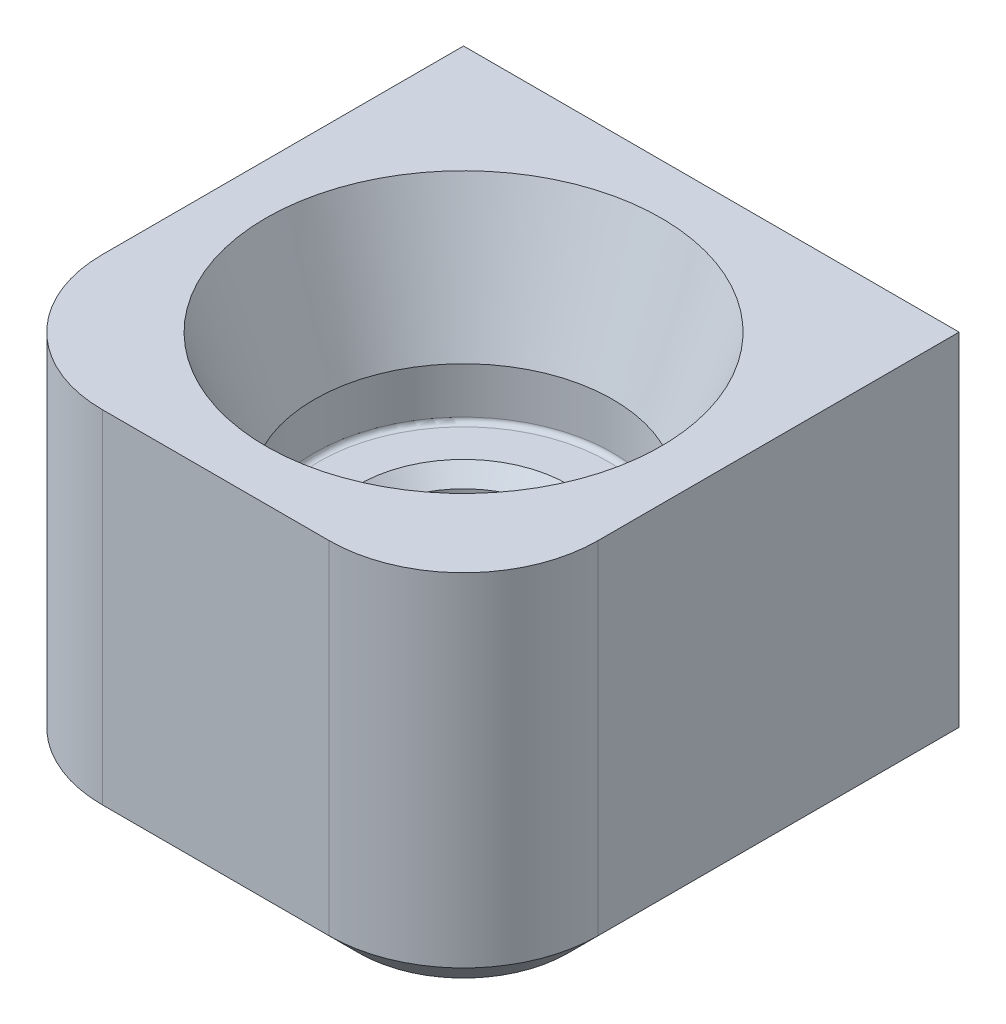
ISO-10303-21;
HEADER;
FILE_DESCRIPTION(('STEP AP214'),'2;1');
FILE_NAME('part.step','',(''),(''),'','','');
FILE_SCHEMA(('AUTOMOTIVE_DESIGN { 1 0 10303 214 1 1 1 1 }'));
ENDSEC;
DATA;
#1=APPLICATION_CONTEXT('core data for automotive mechanical design processes');
#2=APPLICATION_PROTOCOL_DEFINITION('international standard','automotive_design',2000,#1);
#3=PRODUCT_CONTEXT('',#1,'mechanical');
#4=PRODUCT('Part','Part','',(#3));
#5=PRODUCT_RELATED_PRODUCT_CATEGORY('part','',(#4));
#6=PRODUCT_DEFINITION_FORMATION('','',#4);
#7=PRODUCT_DEFINITION_CONTEXT('part definition',#1,'design');
#8=PRODUCT_DEFINITION('design','',#6,#7);
#9=PRODUCT_DEFINITION_SHAPE('','',#8);
#10=(LENGTH_UNIT() NAMED_UNIT(*) SI_UNIT(.MILLI.,.METRE.));
#11=(NAMED_UNIT(*) PLANE_ANGLE_UNIT() SI_UNIT($,.RADIAN.));
#12=(NAMED_UNIT(*) SI_UNIT($,.STERADIAN.) SOLID_ANGLE_UNIT());
#13=UNCERTAINTY_MEASURE_WITH_UNIT(LENGTH_MEASURE(1.E-05),#10,'distance_accuracy_value','');
#14=(GEOMETRIC_REPRESENTATION_CONTEXT(3) GLOBAL_UNCERTAINTY_ASSIGNED_CONTEXT((#13)) GLOBAL_UNIT_ASSIGNED_CONTEXT((#10,
#11,#12)) REPRESENTATION_CONTEXT('',''));
#15=CARTESIAN_POINT('',(0.,0.,0.));
#16=DIRECTION('',(0.,0.,1.));
#17=DIRECTION('',(1.,0.,0.));
#18=AXIS2_PLACEMENT_3D('',#15,#16,#17);
#19=CARTESIAN_POINT('',(-6.3246,9.4996,-6.3246));
#20=DIRECTION('',(1.,0.,0.));
#21=DIRECTION('',(0.,0.,-1.));
#22=AXIS2_PLACEMENT_3D('',#19,#20,#21);
#23=PLANE('',#22);
#24=DIRECTION('',(0.,-1.,0.));
#25=VECTOR('',#24,1.);
#26=CARTESIAN_POINT('',(-6.3246,9.4996,-6.3246));
#27=LINE('',#26,#25);
#28=CARTESIAN_POINT('',(-6.3246,9.4996,-6.3246));
#29=VERTEX_POINT('',#28);
#30=CARTESIAN_POINT('',(-6.3246,0.762000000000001,-6.3246));
#31=VERTEX_POINT('',#30);
#32=EDGE_CURVE('E229',#29,#31,#27,.T.);
#33=ORIENTED_EDGE('',*,*,#32,.T.);
#34=DIRECTION('',(0.,0.,1.));
#35=VECTOR('',#34,1.);
#36=CARTESIAN_POINT('',(-6.3246,0.762000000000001,-6.3246));
#37=LINE('',#36,#35);
#38=CARTESIAN_POINT('',(-6.3246,0.762000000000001,2.8956));
#39=VERTEX_POINT('',#38);
#40=EDGE_CURVE('E132',#31,#39,#37,.T.);
#41=ORIENTED_EDGE('',*,*,#40,.T.);
#42=DIRECTION('',(0.,-1.,0.));
#43=VECTOR('',#42,1.);
#44=CARTESIAN_POINT('',(-6.3246,9.4996,2.8956));
#45=LINE('',#44,#43);
#46=CARTESIAN_POINT('',(-6.3246,9.4996,2.8956));
#47=VERTEX_POINT('',#46);
#48=EDGE_CURVE('E113',#47,#39,#45,.T.);
#49=ORIENTED_EDGE('',*,*,#48,.F.);
#50=DIRECTION('',(0.,0.,1.));
#51=VECTOR('',#50,1.);
#52=CARTESIAN_POINT('',(-6.3246,9.4996,-6.3246));
#53=LINE('',#52,#51);
#54=EDGE_CURVE('E119',#29,#47,#53,.T.);
#55=ORIENTED_EDGE('',*,*,#54,.F.);
#56=EDGE_LOOP('',(#33,#41,#49,#55));
#57=FACE_BOUND('',#56,.T.);
#58=ADVANCED_FACE('F34',(#57),#23,.F.);
#59=CARTESIAN_POINT('',(-2.8956,9.4996,2.8956));
#60=DIRECTION('',(0.,-1.,0.));
#61=DIRECTION('',(0.,0.,-1.));
#62=AXIS2_PLACEMENT_3D('',#59,#60,#61);
#63=CYLINDRICAL_SURFACE('',#62,3.429);
#64=ORIENTED_EDGE('',*,*,#48,.T.);
#65=CARTESIAN_POINT('',(-2.8956,0.762000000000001,2.8956));
#66=DIRECTION('',(0.,1.,0.));
#67=DIRECTION('',(0.,0.,1.));
#68=AXIS2_PLACEMENT_3D('',#65,#66,#67);
#69=CIRCLE('',#68,3.429);
#70=CARTESIAN_POINT('',(-2.8956,0.762000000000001,6.3246));
#71=VERTEX_POINT('',#70);
#72=EDGE_CURVE('E152',#39,#71,#69,.T.);
#73=ORIENTED_EDGE('',*,*,#72,.T.);
#74=DIRECTION('',(0.,-1.,0.));
#75=VECTOR('',#74,1.);
#76=CARTESIAN_POINT('',(-2.8956,9.4996,6.3246));
#77=LINE('',#76,#75);
#78=CARTESIAN_POINT('',(-2.8956,9.4996,6.3246));
#79=VERTEX_POINT('',#78);
#80=EDGE_CURVE('E115',#79,#71,#77,.T.);
#81=ORIENTED_EDGE('',*,*,#80,.F.);
#82=CARTESIAN_POINT('',(-2.8956,9.4996,2.8956));
#83=DIRECTION('',(0.,1.,0.));
#84=DIRECTION('',(0.,0.,1.));
#85=AXIS2_PLACEMENT_3D('',#82,#83,#84);
#86=CIRCLE('',#85,3.429);
#87=EDGE_CURVE('E109',#47,#79,#86,.T.);
#88=ORIENTED_EDGE('',*,*,#87,.F.);
#89=EDGE_LOOP('',(#64,#73,#81,#88));
#90=FACE_BOUND('',#89,.T.);
#91=ADVANCED_FACE('F111',(#90),#63,.T.);
#92=CARTESIAN_POINT('',(-2.8956,9.4996,6.3246));
#93=DIRECTION('',(0.,0.,-1.));
#94=DIRECTION('',(-1.,0.,0.));
#95=AXIS2_PLACEMENT_3D('',#92,#93,#94);
#96=PLANE('',#95);
#97=ORIENTED_EDGE('',*,*,#80,.T.);
#98=DIRECTION('',(1.,0.,0.));
#99=VECTOR('',#98,1.);
#100=CARTESIAN_POINT('',(-2.8956,0.762000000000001,6.3246));
#101=LINE('',#100,#99);
#102=CARTESIAN_POINT('',(2.8956,0.762000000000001,6.3246));
#103=VERTEX_POINT('',#102);
#104=EDGE_CURVE('E154',#71,#103,#101,.T.);
#105=ORIENTED_EDGE('',*,*,#104,.T.);
#106=DIRECTION('',(0.,-1.,0.));
#107=VECTOR('',#106,1.);
#108=CARTESIAN_POINT('',(2.8956,9.4996,6.3246));
#109=LINE('',#108,#107);
#110=CARTESIAN_POINT('',(2.8956,9.4996,6.3246));
#111=VERTEX_POINT('',#110);
#112=EDGE_CURVE('E136',#111,#103,#109,.T.);
#113=ORIENTED_EDGE('',*,*,#112,.F.);
#114=DIRECTION('',(1.,0.,0.));
#115=VECTOR('',#114,1.);
#116=CARTESIAN_POINT('',(-2.8956,9.4996,6.3246));
#117=LINE('',#116,#115);
#118=EDGE_CURVE('E118',#79,#111,#117,.T.);
#119=ORIENTED_EDGE('',*,*,#118,.F.);
#120=EDGE_LOOP('',(#97,#105,#113,#119));
#121=FACE_BOUND('',#120,.T.);
#122=ADVANCED_FACE('F211',(#121),#96,.F.);
#123=CARTESIAN_POINT('',(2.8956,9.4996,2.8956));
#124=DIRECTION('',(0.,-1.,0.));
#125=DIRECTION('',(0.,0.,-1.));
#126=AXIS2_PLACEMENT_3D('',#123,#124,#125);
#127=CYLINDRICAL_SURFACE('',#126,3.429);
#128=ORIENTED_EDGE('',*,*,#112,.T.);
#129=CARTESIAN_POINT('',(2.8956,0.762000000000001,2.8956));
#130=DIRECTION('',(0.,1.,0.));
#131=DIRECTION('',(0.,0.,1.));
#132=AXIS2_PLACEMENT_3D('',#129,#130,#131);
#133=CIRCLE('',#132,3.429);
#134=CARTESIAN_POINT('',(6.3246,0.762000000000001,2.8956));
#135=VERTEX_POINT('',#134);
#136=EDGE_CURVE('E58',#103,#135,#133,.T.);
#137=ORIENTED_EDGE('',*,*,#136,.T.);
#138=DIRECTION('',(0.,-1.,0.));
#139=VECTOR('',#138,1.);
#140=CARTESIAN_POINT('',(6.3246,9.4996,2.8956));
#141=LINE('',#140,#139);
#142=CARTESIAN_POINT('',(6.3246,9.4996,2.8956));
#143=VERTEX_POINT('',#142);
#144=EDGE_CURVE('E232',#143,#135,#141,.T.);
#145=ORIENTED_EDGE('',*,*,#144,.F.);
#146=CARTESIAN_POINT('',(2.8956,9.4996,2.8956));
#147=DIRECTION('',(0.,1.,0.));
#148=DIRECTION('',(0.,0.,1.));
#149=AXIS2_PLACEMENT_3D('',#146,#147,#148);
#150=CIRCLE('',#149,3.429);
#151=EDGE_CURVE('E240',#111,#143,#150,.T.);
#152=ORIENTED_EDGE('',*,*,#151,.F.);
#153=EDGE_LOOP('',(#128,#137,#145,#152));
#154=FACE_BOUND('',#153,.T.);
#155=ADVANCED_FACE('F239',(#154),#127,.T.);
#156=CARTESIAN_POINT('',(6.3246,9.4996,-6.3246));
#157=DIRECTION('',(-1.,0.,0.));
#158=DIRECTION('',(0.,0.,1.));
#159=AXIS2_PLACEMENT_3D('',#156,#157,#158);
#160=PLANE('',#159);
#161=ORIENTED_EDGE('',*,*,#144,.T.);
#162=DIRECTION('',(0.,0.,-1.));
#163=VECTOR('',#162,1.);
#164=CARTESIAN_POINT('',(6.3246,0.762000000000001,-6.3246));
#165=LINE('',#164,#163);
#166=CARTESIAN_POINT('',(6.3246,0.762000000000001,-6.3246));
#167=VERTEX_POINT('',#166);
#168=EDGE_CURVE('E50',#135,#167,#165,.T.);
#169=ORIENTED_EDGE('',*,*,#168,.T.);
#170=DIRECTION('',(0.,-1.,0.));
#171=VECTOR('',#170,1.);
#172=CARTESIAN_POINT('',(6.3246,9.4996,-6.3246));
#173=LINE('',#172,#171);
#174=CARTESIAN_POINT('',(6.3246,9.4996,-6.3246));
#175=VERTEX_POINT('',#174);
#176=EDGE_CURVE('E230',#175,#167,#173,.T.);
#177=ORIENTED_EDGE('',*,*,#176,.F.);
#178=DIRECTION('',(0.,0.,-1.));
#179=VECTOR('',#178,1.);
#180=CARTESIAN_POINT('',(6.3246,9.4996,-6.3246));
#181=LINE('',#180,#179);
#182=EDGE_CURVE('E234',#143,#175,#181,.T.);
#183=ORIENTED_EDGE('',*,*,#182,.F.);
#184=EDGE_LOOP('',(#161,#169,#177,#183));
#185=FACE_BOUND('',#184,.T.);
#186=ADVANCED_FACE('F263',(#185),#160,.F.);
#187=CARTESIAN_POINT('',(-6.3246,9.4996,-6.3246));
#188=DIRECTION('',(0.,0.,1.));
#189=DIRECTION('',(1.,0.,0.));
#190=AXIS2_PLACEMENT_3D('',#187,#188,#189);
#191=PLANE('',#190);
#192=ORIENTED_EDGE('',*,*,#176,.T.);
#193=DIRECTION('',(-1.,0.,0.));
#194=VECTOR('',#193,1.);
#195=CARTESIAN_POINT('',(-6.3246,0.762000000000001,-6.3246));
#196=LINE('',#195,#194);
#197=EDGE_CURVE('E157',#167,#31,#196,.T.);
#198=ORIENTED_EDGE('',*,*,#197,.T.);
#199=ORIENTED_EDGE('',*,*,#32,.F.);
#200=DIRECTION('',(-1.,0.,0.));
#201=VECTOR('',#200,1.);
#202=CARTESIAN_POINT('',(-6.3246,9.4996,-6.3246));
#203=LINE('',#202,#201);
#204=EDGE_CURVE('E124',#175,#29,#203,.T.);
#205=ORIENTED_EDGE('',*,*,#204,.F.);
#206=EDGE_LOOP('',(#192,#198,#199,#205));
#207=FACE_BOUND('',#206,.T.);
#208=ADVANCED_FACE('F228',(#207),#191,.F.);
#209=CARTESIAN_POINT('',(-2.8956,9.4996,2.8956));
#210=DIRECTION('',(0.,1.,0.));
#211=DIRECTION('',(0.,0.,1.));
#212=AXIS2_PLACEMENT_3D('',#209,#210,#211);
#213=PLANE('',#212);
#214=CARTESIAN_POINT('',(0.,9.4996,0.));
#215=DIRECTION('',(0.,1.,0.));
#216=DIRECTION('',(-1.,0.,0.));
#217=AXIS2_PLACEMENT_3D('',#214,#215,#216);
#218=CIRCLE('',#217,5.04503453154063);
#219=CARTESIAN_POINT('',(-5.04503453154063,9.4996,0.));
#220=VERTEX_POINT('',#219);
#221=EDGE_CURVE('E177',#220,#220,#218,.T.);
#222=ORIENTED_EDGE('',*,*,#221,.F.);
#223=EDGE_LOOP('',(#222));
#224=FACE_BOUND('',#223,.T.);
#225=ORIENTED_EDGE('',*,*,#54,.T.);
#226=ORIENTED_EDGE('',*,*,#87,.T.);
#227=ORIENTED_EDGE('',*,*,#118,.T.);
#228=ORIENTED_EDGE('',*,*,#151,.T.);
#229=ORIENTED_EDGE('',*,*,#182,.T.);
#230=ORIENTED_EDGE('',*,*,#204,.T.);
#231=EDGE_LOOP('',(#225,#226,#227,#228,#229,#230));
#232=FACE_BOUND('',#231,.T.);
#233=ADVANCED_FACE('F122',(#224,#232),#213,.T.);
#234=CARTESIAN_POINT('',(-2.8956,0.,2.8956));
#235=DIRECTION('',(0.,1.,0.));
#236=DIRECTION('',(0.,0.,1.));
#237=AXIS2_PLACEMENT_3D('',#234,#235,#236);
#238=PLANE('',#237);
#239=CARTESIAN_POINT('',(0.,0.,0.));
#240=DIRECTION('',(0.,1.,0.));
#241=DIRECTION('',(0.,0.,1.));
#242=AXIS2_PLACEMENT_3D('',#239,#240,#241);
#243=CIRCLE('',#242,2.667);
#244=CARTESIAN_POINT('',(0.,0.,2.667));
#245=VERTEX_POINT('',#244);
#246=EDGE_CURVE('E160',#245,#245,#243,.T.);
#247=ORIENTED_EDGE('',*,*,#246,.T.);
#248=EDGE_LOOP('',(#247));
#249=FACE_BOUND('',#248,.T.);
#250=CARTESIAN_POINT('',(-2.8956,0.,2.8956));
#251=DIRECTION('',(0.,1.,0.));
#252=DIRECTION('',(0.,0.,1.));
#253=AXIS2_PLACEMENT_3D('',#250,#251,#252);
#254=CIRCLE('',#253,2.667);
#255=CARTESIAN_POINT('',(-2.8956,0.,5.5626));
#256=VERTEX_POINT('',#255);
#257=CARTESIAN_POINT('',(-5.5626,0.,2.8956));
#258=VERTEX_POINT('',#257);
#259=EDGE_CURVE('E147',#256,#258,#254,.F.);
#260=ORIENTED_EDGE('',*,*,#259,.T.);
#261=DIRECTION('',(0.,0.,-1.));
#262=VECTOR('',#261,1.);
#263=CARTESIAN_POINT('',(-5.5626,0.,2.8956));
#264=LINE('',#263,#262);
#265=CARTESIAN_POINT('',(-5.5626,0.,-5.5626));
#266=VERTEX_POINT('',#265);
#267=EDGE_CURVE('E149',#258,#266,#264,.T.);
#268=ORIENTED_EDGE('',*,*,#267,.T.);
#269=DIRECTION('',(1.,0.,0.));
#270=VECTOR('',#269,1.);
#271=CARTESIAN_POINT('',(-2.8956,0.,-5.5626));
#272=LINE('',#271,#270);
#273=CARTESIAN_POINT('',(5.5626,0.,-5.5626));
#274=VERTEX_POINT('',#273);
#275=EDGE_CURVE('E141',#266,#274,#272,.T.);
#276=ORIENTED_EDGE('',*,*,#275,.T.);
#277=DIRECTION('',(0.,0.,1.));
#278=VECTOR('',#277,1.);
#279=CARTESIAN_POINT('',(5.5626,0.,2.8956));
#280=LINE('',#279,#278);
#281=CARTESIAN_POINT('',(5.5626,0.,2.8956));
#282=VERTEX_POINT('',#281);
#283=EDGE_CURVE('E134',#274,#282,#280,.T.);
#284=ORIENTED_EDGE('',*,*,#283,.T.);
#285=CARTESIAN_POINT('',(2.8956,0.,2.8956));
#286=DIRECTION('',(0.,1.,0.));
#287=DIRECTION('',(0.,0.,1.));
#288=AXIS2_PLACEMENT_3D('',#285,#286,#287);
#289=CIRCLE('',#288,2.667);
#290=CARTESIAN_POINT('',(2.8956,0.,5.5626));
#291=VERTEX_POINT('',#290);
#292=EDGE_CURVE('E143',#282,#291,#289,.F.);
#293=ORIENTED_EDGE('',*,*,#292,.T.);
#294=DIRECTION('',(-1.,0.,0.));
#295=VECTOR('',#294,1.);
#296=CARTESIAN_POINT('',(-2.8956,0.,5.5626));
#297=LINE('',#296,#295);
#298=EDGE_CURVE('E145',#291,#256,#297,.T.);
#299=ORIENTED_EDGE('',*,*,#298,.T.);
#300=EDGE_LOOP('',(#260,#268,#276,#284,#293,#299));
#301=FACE_BOUND('',#300,.T.);
#302=ADVANCED_FACE('F194',(#249,#301),#238,.F.);
#303=CARTESIAN_POINT('',(0.,9.4996,0.));
#304=DIRECTION('',(0.,1.,0.));
#305=DIRECTION('',(-1.,0.,0.));
#306=AXIS2_PLACEMENT_3D('',#303,#304,#305);
#307=CYLINDRICAL_SURFACE('',#306,2.286);
#308=CARTESIAN_POINT('',(0.,0.380999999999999,0.));
#309=DIRECTION('',(0.,1.,0.));
#310=DIRECTION('',(-1.,0.,0.));
#311=AXIS2_PLACEMENT_3D('',#308,#309,#310);
#312=CIRCLE('',#311,2.286);
#313=CARTESIAN_POINT('',(-2.286,0.380999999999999,0.));
#314=VERTEX_POINT('',#313);
#315=EDGE_CURVE('E43',#314,#314,#312,.F.);
#316=ORIENTED_EDGE('',*,*,#315,.T.);
#317=EDGE_LOOP('',(#316));
#318=FACE_BOUND('',#317,.T.);
#319=CARTESIAN_POINT('',(0.,4.4196,0.));
#320=DIRECTION('',(0.,-1.,0.));
#321=DIRECTION('',(1.,0.,0.));
#322=AXIS2_PLACEMENT_3D('',#319,#320,#321);
#323=CIRCLE('',#322,2.286);
#324=CARTESIAN_POINT('',(2.286,4.4196,0.));
#325=VERTEX_POINT('',#324);
#326=EDGE_CURVE('E180',#325,#325,#323,.F.);
#327=ORIENTED_EDGE('',*,*,#326,.T.);
#328=EDGE_LOOP('',(#327));
#329=FACE_BOUND('',#328,.T.);
#330=ADVANCED_FACE('F185',(#318,#329),#307,.F.);
#331=CARTESIAN_POINT('',(-3.683,4.8006,0.));
#332=DIRECTION('',(0.,-1.,0.));
#333=DIRECTION('',(1.,0.,0.));
#334=AXIS2_PLACEMENT_3D('',#331,#332,#333);
#335=PLANE('',#334);
#336=CARTESIAN_POINT('',(0.,4.8006,0.));
#337=DIRECTION('',(0.,-1.,0.));
#338=DIRECTION('',(1.,0.,0.));
#339=AXIS2_PLACEMENT_3D('',#336,#337,#338);
#340=CIRCLE('',#339,2.667);
#341=CARTESIAN_POINT('',(2.667,4.8006,0.));
#342=VERTEX_POINT('',#341);
#343=EDGE_CURVE('E11',#342,#342,#340,.T.);
#344=ORIENTED_EDGE('',*,*,#343,.T.);
#345=EDGE_LOOP('',(#344));
#346=FACE_BOUND('',#345,.T.);
#347=CARTESIAN_POINT('',(0.,4.8006,0.));
#348=DIRECTION('',(0.,1.,0.));
#349=DIRECTION('',(-1.,0.,0.));
#350=AXIS2_PLACEMENT_3D('',#347,#348,#349);
#351=CIRCLE('',#350,3.683);
#352=CARTESIAN_POINT('',(-3.683,4.8006,0.));
#353=VERTEX_POINT('',#352);
#354=EDGE_CURVE('E128',#353,#353,#351,.T.);
#355=ORIENTED_EDGE('',*,*,#354,.T.);
#356=EDGE_LOOP('',(#355));
#357=FACE_BOUND('',#356,.T.);
#358=ADVANCED_FACE('F324',(#346,#357),#335,.F.);
#359=CARTESIAN_POINT('',(0.,4.9276,0.));
#360=DIRECTION('',(0.,1.,0.));
#361=DIRECTION('',(-1.,0.,0.));
#362=AXIS2_PLACEMENT_3D('',#359,#360,#361);
#363=TOROIDAL_SURFACE('',#362,3.683,0.127);
#364=ORIENTED_EDGE('',*,*,#354,.F.);
#365=EDGE_LOOP('',(#364));
#366=FACE_BOUND('',#365,.T.);
#367=CARTESIAN_POINT('',(0.,4.9276,0.));
#368=DIRECTION('',(0.,1.,0.));
#369=DIRECTION('',(-1.,0.,0.));
#370=AXIS2_PLACEMENT_3D('',#367,#368,#369);
#371=CIRCLE('',#370,3.81);
#372=CARTESIAN_POINT('',(-3.81,4.9276,0.));
#373=VERTEX_POINT('',#372);
#374=EDGE_CURVE('E247',#373,#373,#371,.T.);
#375=ORIENTED_EDGE('',*,*,#374,.T.);
#376=EDGE_LOOP('',(#375));
#377=FACE_BOUND('',#376,.T.);
#378=ADVANCED_FACE('F317',(#366,#377),#363,.F.);
#379=CARTESIAN_POINT('',(0.,9.4996,0.));
#380=DIRECTION('',(0.,1.,0.));
#381=DIRECTION('',(-1.,0.,0.));
#382=AXIS2_PLACEMENT_3D('',#379,#380,#381);
#383=CYLINDRICAL_SURFACE('',#382,3.81);
#384=ORIENTED_EDGE('',*,*,#374,.F.);
#385=EDGE_LOOP('',(#384));
#386=FACE_BOUND('',#385,.T.);
#387=CARTESIAN_POINT('',(0.,6.10637051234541,0.));
#388=DIRECTION('',(0.,1.,0.));
#389=DIRECTION('',(-1.,0.,0.));
#390=AXIS2_PLACEMENT_3D('',#387,#388,#389);
#391=CIRCLE('',#390,3.81);
#392=CARTESIAN_POINT('',(-3.81,6.10637051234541,0.));
#393=VERTEX_POINT('',#392);
#394=EDGE_CURVE('E250',#393,#393,#391,.T.);
#395=ORIENTED_EDGE('',*,*,#394,.T.);
#396=EDGE_LOOP('',(#395));
#397=FACE_BOUND('',#396,.T.);
#398=ADVANCED_FACE('F311',(#386,#397),#383,.F.);
#399=CARTESIAN_POINT('',(0.,9.4996,0.));
#400=DIRECTION('',(0.,1.,0.));
#401=DIRECTION('',(-1.,0.,0.));
#402=AXIS2_PLACEMENT_3D('',#399,#400,#401);
#403=CONICAL_SURFACE('',#402,5.04503453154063,0.349065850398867);
#404=ORIENTED_EDGE('',*,*,#394,.F.);
#405=EDGE_LOOP('',(#404));
#406=FACE_BOUND('',#405,.T.);
#407=ORIENTED_EDGE('',*,*,#221,.T.);
#408=EDGE_LOOP('',(#407));
#409=FACE_BOUND('',#408,.T.);
#410=ADVANCED_FACE('F256',(#406,#409),#403,.F.);
#411=CARTESIAN_POINT('',(2.8956,0.762000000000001,2.8956));
#412=DIRECTION('',(0.,1.,0.));
#413=DIRECTION('',(0.,0.,1.));
#414=AXIS2_PLACEMENT_3D('',#411,#412,#413);
#415=CONICAL_SURFACE('',#414,3.429,0.78539816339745);
#416=DIRECTION('',(0.,0.707106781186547,0.707106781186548));
#417=VECTOR('',#416,1.);
#418=CARTESIAN_POINT('',(2.8956,0.,5.5626));
#419=LINE('',#418,#417);
#420=EDGE_CURVE('E171',#291,#103,#419,.T.);
#421=ORIENTED_EDGE('',*,*,#420,.F.);
#422=ORIENTED_EDGE('',*,*,#292,.F.);
#423=DIRECTION('',(-0.707106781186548,-0.707106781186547,0.));
#424=VECTOR('',#423,1.);
#425=CARTESIAN_POINT('',(6.3246,0.762000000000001,2.8956));
#426=LINE('',#425,#424);
#427=EDGE_CURVE('E174',#135,#282,#426,.T.);
#428=ORIENTED_EDGE('',*,*,#427,.F.);
#429=ORIENTED_EDGE('',*,*,#136,.F.);
#430=EDGE_LOOP('',(#421,#422,#428,#429));
#431=FACE_BOUND('',#430,.T.);
#432=ADVANCED_FACE('F218',(#431),#415,.T.);
#433=CARTESIAN_POINT('',(6.3246,0.762000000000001,-6.3246));
#434=DIRECTION('',(-0.707106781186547,0.707106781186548,0.));
#435=DIRECTION('',(0.,0.,-1.));
#436=AXIS2_PLACEMENT_3D('',#433,#434,#435);
#437=PLANE('',#436);
#438=ORIENTED_EDGE('',*,*,#427,.T.);
#439=ORIENTED_EDGE('',*,*,#283,.F.);
#440=DIRECTION('',(0.577350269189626,0.577350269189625,-0.577350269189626));
#441=VECTOR('',#440,1.);
#442=CARTESIAN_POINT('',(6.3246,0.762000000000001,-6.3246));
#443=LINE('',#442,#441);
#444=EDGE_CURVE('E168',#167,#274,#443,.F.);
#445=ORIENTED_EDGE('',*,*,#444,.F.);
#446=ORIENTED_EDGE('',*,*,#168,.F.);
#447=EDGE_LOOP('',(#438,#439,#445,#446));
#448=FACE_BOUND('',#447,.T.);
#449=ADVANCED_FACE('F223',(#448),#437,.F.);
#450=CARTESIAN_POINT('',(-2.8956,0.762000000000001,6.3246));
#451=DIRECTION('',(0.,0.707106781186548,-0.707106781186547));
#452=DIRECTION('',(1.,0.,0.));
#453=AXIS2_PLACEMENT_3D('',#450,#451,#452);
#454=PLANE('',#453);
#455=ORIENTED_EDGE('',*,*,#420,.T.);
#456=ORIENTED_EDGE('',*,*,#104,.F.);
#457=DIRECTION('',(0.,0.707106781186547,0.707106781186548));
#458=VECTOR('',#457,1.);
#459=CARTESIAN_POINT('',(-2.8956,0.,5.5626));
#460=LINE('',#459,#458);
#461=EDGE_CURVE('E165',#256,#71,#460,.T.);
#462=ORIENTED_EDGE('',*,*,#461,.F.);
#463=ORIENTED_EDGE('',*,*,#298,.F.);
#464=EDGE_LOOP('',(#455,#456,#462,#463));
#465=FACE_BOUND('',#464,.T.);
#466=ADVANCED_FACE('F214',(#465),#454,.F.);
#467=CARTESIAN_POINT('',(-6.3246,0.762000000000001,-6.3246));
#468=DIRECTION('',(0.,0.707106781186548,0.707106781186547));
#469=DIRECTION('',(-1.,0.,0.));
#470=AXIS2_PLACEMENT_3D('',#467,#468,#469);
#471=PLANE('',#470);
#472=ORIENTED_EDGE('',*,*,#444,.T.);
#473=ORIENTED_EDGE('',*,*,#275,.F.);
#474=DIRECTION('',(-0.577350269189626,0.577350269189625,-0.577350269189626));
#475=VECTOR('',#474,1.);
#476=CARTESIAN_POINT('',(-6.3246,0.762000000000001,-6.3246));
#477=LINE('',#476,#475);
#478=EDGE_CURVE('E163',#31,#266,#477,.F.);
#479=ORIENTED_EDGE('',*,*,#478,.F.);
#480=ORIENTED_EDGE('',*,*,#197,.F.);
#481=EDGE_LOOP('',(#472,#473,#479,#480));
#482=FACE_BOUND('',#481,.T.);
#483=ADVANCED_FACE('F226',(#482),#471,.F.);
#484=CARTESIAN_POINT('',(-2.8956,0.762000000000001,2.8956));
#485=DIRECTION('',(0.,1.,0.));
#486=DIRECTION('',(0.,0.,1.));
#487=AXIS2_PLACEMENT_3D('',#484,#485,#486);
#488=CONICAL_SURFACE('',#487,3.429,0.78539816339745);
#489=ORIENTED_EDGE('',*,*,#461,.T.);
#490=ORIENTED_EDGE('',*,*,#72,.F.);
#491=DIRECTION('',(-0.707106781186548,0.707106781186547,0.));
#492=VECTOR('',#491,1.);
#493=CARTESIAN_POINT('',(-5.5626,0.,2.8956));
#494=LINE('',#493,#492);
#495=EDGE_CURVE('E161',#258,#39,#494,.T.);
#496=ORIENTED_EDGE('',*,*,#495,.F.);
#497=ORIENTED_EDGE('',*,*,#259,.F.);
#498=EDGE_LOOP('',(#489,#490,#496,#497));
#499=FACE_BOUND('',#498,.T.);
#500=ADVANCED_FACE('F208',(#499),#488,.T.);
#501=CARTESIAN_POINT('',(-6.3246,0.762000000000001,-6.3246));
#502=DIRECTION('',(0.707106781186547,0.707106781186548,0.));
#503=DIRECTION('',(0.,0.,1.));
#504=AXIS2_PLACEMENT_3D('',#501,#502,#503);
#505=PLANE('',#504);
#506=ORIENTED_EDGE('',*,*,#478,.T.);
#507=ORIENTED_EDGE('',*,*,#267,.F.);
#508=ORIENTED_EDGE('',*,*,#495,.T.);
#509=ORIENTED_EDGE('',*,*,#40,.F.);
#510=EDGE_LOOP('',(#506,#507,#508,#509));
#511=FACE_BOUND('',#510,.T.);
#512=ADVANCED_FACE('F191',(#511),#505,.F.);
#513=CARTESIAN_POINT('',(0.,0.,0.));
#514=DIRECTION('',(0.,-1.,0.));
#515=DIRECTION('',(1.,0.,0.));
#516=AXIS2_PLACEMENT_3D('',#513,#514,#515);
#517=CONICAL_SURFACE('',#516,2.667,0.785398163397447);
#518=ORIENTED_EDGE('',*,*,#315,.F.);
#519=EDGE_LOOP('',(#518));
#520=FACE_BOUND('',#519,.T.);
#521=ORIENTED_EDGE('',*,*,#246,.F.);
#522=EDGE_LOOP('',(#521));
#523=FACE_BOUND('',#522,.T.);
#524=ADVANCED_FACE('F188',(#520,#523),#517,.F.);
#525=CARTESIAN_POINT('',(0.,4.4196,0.));
#526=DIRECTION('',(0.,1.,0.));
#527=DIRECTION('',(-1.,0.,0.));
#528=AXIS2_PLACEMENT_3D('',#525,#526,#527);
#529=CONICAL_SURFACE('',#528,2.286,0.785398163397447);
#530=ORIENTED_EDGE('',*,*,#343,.F.);
#531=EDGE_LOOP('',(#530));
#532=FACE_BOUND('',#531,.T.);
#533=ORIENTED_EDGE('',*,*,#326,.F.);
#534=EDGE_LOOP('',(#533));
#535=FACE_BOUND('',#534,.T.);
#536=ADVANCED_FACE('F37',(#532,#535),#529,.F.);
#537=CLOSED_SHELL('',(#58,#91,#122,#155,#186,#208,#233,#302,#330,#358,#378,#398,#410,#432,#449,
#466,#483,#500,#512,#524,#536));
#538=MANIFOLD_SOLID_BREP('B2',#537);
#539=ADVANCED_BREP_SHAPE_REPRESENTATION('',(#18,#538),#14);
#540=SHAPE_DEFINITION_REPRESENTATION(#9,#539);
ENDSEC;
END-ISO-10303-21;
